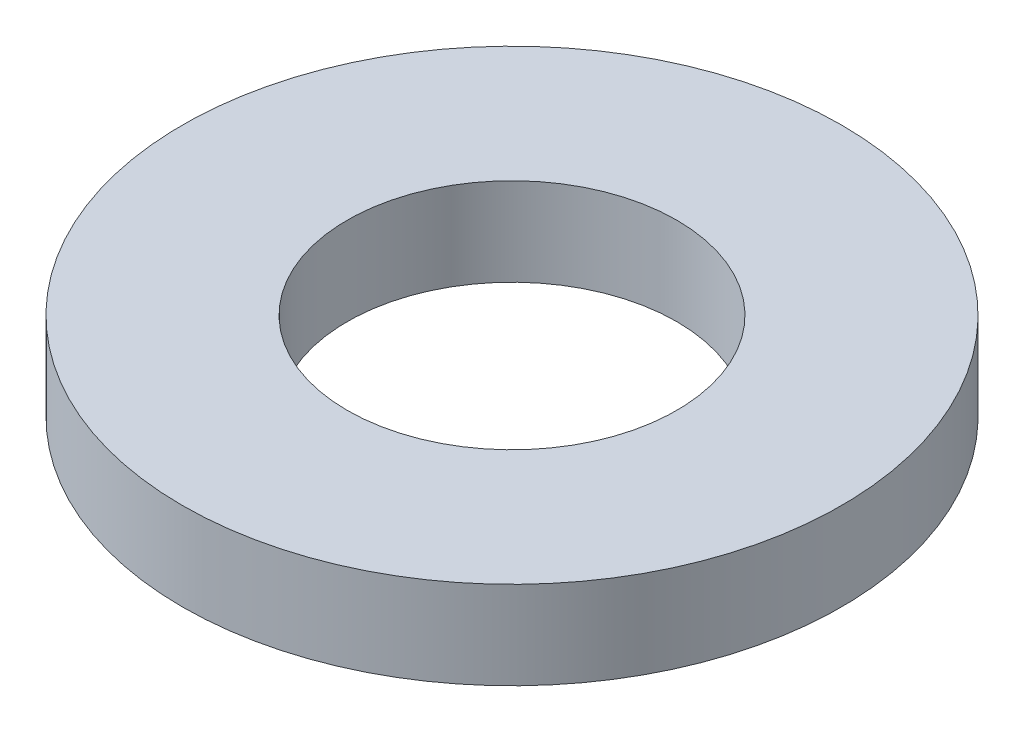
from build123d import *

# Parameters (mm, degrees)
ESQUISSE1_R      = 3
ESQUISSE1_R_2    = 1.5
EXTRUSION1_DEPTH = 0.8


with BuildPart() as part:
    # Esquisse1 → Extrusion1 (new body)
    with BuildSketch(Plane(origin=(0, 0, 0), x_dir=(1, 0, 0), z_dir=(0, 1, 0))):
        with Locations(Location((0, 0, 0), (0, 0, 270))):
            Circle(ESQUISSE1_R)
        with Locations(Location((0, 0, 0), (0, 0, 270))):
            Circle(ESQUISSE1_R_2, mode=Mode.SUBTRACT)
    extrude(amount=EXTRUSION1_DEPTH)


solid = part.part
